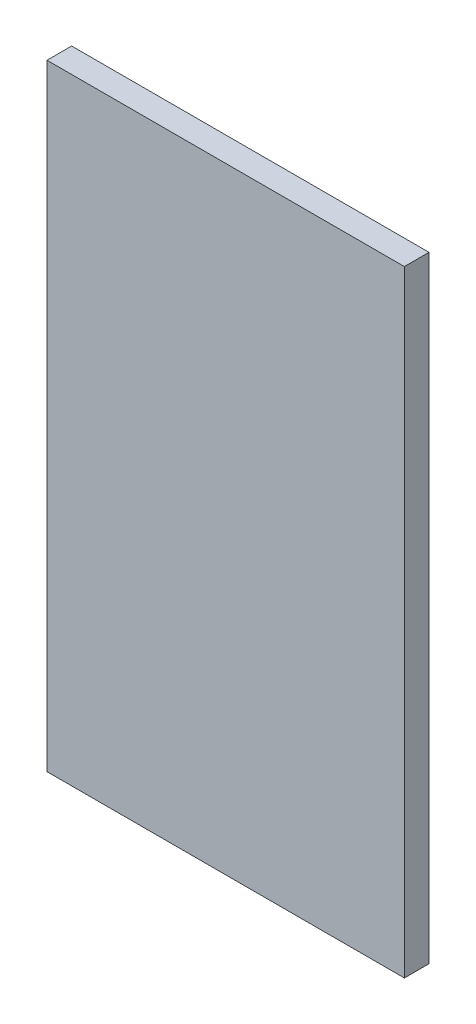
ISO-10303-21;
HEADER;
FILE_DESCRIPTION(('STEP AP214'),'2;1');
FILE_NAME('part.step','',(''),(''),'','','');
FILE_SCHEMA(('AUTOMOTIVE_DESIGN { 1 0 10303 214 1 1 1 1 }'));
ENDSEC;
DATA;
#1=APPLICATION_CONTEXT('core data for automotive mechanical design processes');
#2=APPLICATION_PROTOCOL_DEFINITION('international standard','automotive_design',2000,#1);
#3=PRODUCT_CONTEXT('',#1,'mechanical');
#4=PRODUCT('Part','Part','',(#3));
#5=PRODUCT_RELATED_PRODUCT_CATEGORY('part','',(#4));
#6=PRODUCT_DEFINITION_FORMATION('','',#4);
#7=PRODUCT_DEFINITION_CONTEXT('part definition',#1,'design');
#8=PRODUCT_DEFINITION('design','',#6,#7);
#9=PRODUCT_DEFINITION_SHAPE('','',#8);
#10=(LENGTH_UNIT() NAMED_UNIT(*) SI_UNIT(.MILLI.,.METRE.));
#11=(NAMED_UNIT(*) PLANE_ANGLE_UNIT() SI_UNIT($,.RADIAN.));
#12=(NAMED_UNIT(*) SI_UNIT($,.STERADIAN.) SOLID_ANGLE_UNIT());
#13=UNCERTAINTY_MEASURE_WITH_UNIT(LENGTH_MEASURE(1.E-05),#10,'distance_accuracy_value','');
#14=(GEOMETRIC_REPRESENTATION_CONTEXT(3) GLOBAL_UNCERTAINTY_ASSIGNED_CONTEXT((#13)) GLOBAL_UNIT_ASSIGNED_CONTEXT((#10,
#11,#12)) REPRESENTATION_CONTEXT('',''));
#15=CARTESIAN_POINT('',(0.,0.,0.));
#16=DIRECTION('',(0.,0.,1.));
#17=DIRECTION('',(1.,0.,0.));
#18=AXIS2_PLACEMENT_3D('',#15,#16,#17);
#19=CARTESIAN_POINT('',(0.,0.,12.));
#20=DIRECTION('',(0.,0.,1.));
#21=DIRECTION('',(1.,0.,0.));
#22=AXIS2_PLACEMENT_3D('',#19,#20,#21);
#23=PLANE('',#22);
#24=DIRECTION('',(1.,0.,0.));
#25=VECTOR('',#24,1.);
#26=CARTESIAN_POINT('',(-87.,-150.,12.));
#27=LINE('',#26,#25);
#28=CARTESIAN_POINT('',(-87.,-150.,12.));
#29=VERTEX_POINT('',#28);
#30=CARTESIAN_POINT('',(87.,-150.,12.));
#31=VERTEX_POINT('',#30);
#32=EDGE_CURVE('E80',#29,#31,#27,.T.);
#33=ORIENTED_EDGE('',*,*,#32,.T.);
#34=DIRECTION('',(0.,1.,0.));
#35=VECTOR('',#34,1.);
#36=CARTESIAN_POINT('',(87.,-150.,12.));
#37=LINE('',#36,#35);
#38=CARTESIAN_POINT('',(87.,150.,12.));
#39=VERTEX_POINT('',#38);
#40=EDGE_CURVE('E96',#31,#39,#37,.T.);
#41=ORIENTED_EDGE('',*,*,#40,.T.);
#42=DIRECTION('',(-1.,0.,0.));
#43=VECTOR('',#42,1.);
#44=CARTESIAN_POINT('',(87.,150.,12.));
#45=LINE('',#44,#43);
#46=CARTESIAN_POINT('',(-87.,150.,12.));
#47=VERTEX_POINT('',#46);
#48=EDGE_CURVE('E73',#39,#47,#45,.T.);
#49=ORIENTED_EDGE('',*,*,#48,.T.);
#50=DIRECTION('',(0.,-1.,0.));
#51=VECTOR('',#50,1.);
#52=CARTESIAN_POINT('',(-87.,150.,12.));
#53=LINE('',#52,#51);
#54=EDGE_CURVE('E10',#47,#29,#53,.T.);
#55=ORIENTED_EDGE('',*,*,#54,.T.);
#56=EDGE_LOOP('',(#33,#41,#49,#55));
#57=FACE_BOUND('',#56,.T.);
#58=ADVANCED_FACE('F16',(#57),#23,.T.);
#59=CARTESIAN_POINT('',(0.,0.,0.));
#60=DIRECTION('',(0.,0.,1.));
#61=DIRECTION('',(1.,0.,0.));
#62=AXIS2_PLACEMENT_3D('',#59,#60,#61);
#63=PLANE('',#62);
#64=DIRECTION('',(0.,-1.,0.));
#65=VECTOR('',#64,1.);
#66=CARTESIAN_POINT('',(-87.,150.,0.));
#67=LINE('',#66,#65);
#68=CARTESIAN_POINT('',(-87.,150.,0.));
#69=VERTEX_POINT('',#68);
#70=CARTESIAN_POINT('',(-87.,-150.,0.));
#71=VERTEX_POINT('',#70);
#72=EDGE_CURVE('E24',#69,#71,#67,.T.);
#73=ORIENTED_EDGE('',*,*,#72,.F.);
#74=DIRECTION('',(-1.,0.,0.));
#75=VECTOR('',#74,1.);
#76=CARTESIAN_POINT('',(87.,150.,0.));
#77=LINE('',#76,#75);
#78=CARTESIAN_POINT('',(87.,150.,0.));
#79=VERTEX_POINT('',#78);
#80=EDGE_CURVE('E95',#79,#69,#77,.T.);
#81=ORIENTED_EDGE('',*,*,#80,.F.);
#82=DIRECTION('',(0.,1.,0.));
#83=VECTOR('',#82,1.);
#84=CARTESIAN_POINT('',(87.,-150.,0.));
#85=LINE('',#84,#83);
#86=CARTESIAN_POINT('',(87.,-150.,0.));
#87=VERTEX_POINT('',#86);
#88=EDGE_CURVE('E82',#87,#79,#85,.T.);
#89=ORIENTED_EDGE('',*,*,#88,.F.);
#90=DIRECTION('',(1.,0.,0.));
#91=VECTOR('',#90,1.);
#92=CARTESIAN_POINT('',(-87.,-150.,0.));
#93=LINE('',#92,#91);
#94=EDGE_CURVE('E78',#71,#87,#93,.T.);
#95=ORIENTED_EDGE('',*,*,#94,.F.);
#96=EDGE_LOOP('',(#73,#81,#89,#95));
#97=FACE_BOUND('',#96,.T.);
#98=ADVANCED_FACE('F84',(#97),#63,.F.);
#99=CARTESIAN_POINT('',(-87.,150.,0.));
#100=DIRECTION('',(1.,0.,0.));
#101=DIRECTION('',(0.,1.,0.));
#102=AXIS2_PLACEMENT_3D('',#99,#100,#101);
#103=PLANE('',#102);
#104=ORIENTED_EDGE('',*,*,#72,.T.);
#105=DIRECTION('',(0.,0.,1.));
#106=VECTOR('',#105,1.);
#107=CARTESIAN_POINT('',(-87.,-150.,0.));
#108=LINE('',#107,#106);
#109=EDGE_CURVE('E67',#71,#29,#108,.T.);
#110=ORIENTED_EDGE('',*,*,#109,.T.);
#111=ORIENTED_EDGE('',*,*,#54,.F.);
#112=DIRECTION('',(0.,0.,1.));
#113=VECTOR('',#112,1.);
#114=CARTESIAN_POINT('',(-87.,150.,0.));
#115=LINE('',#114,#113);
#116=EDGE_CURVE('E70',#69,#47,#115,.T.);
#117=ORIENTED_EDGE('',*,*,#116,.F.);
#118=EDGE_LOOP('',(#104,#110,#111,#117));
#119=FACE_BOUND('',#118,.T.);
#120=ADVANCED_FACE('F66',(#119),#103,.F.);
#121=CARTESIAN_POINT('',(87.,150.,0.));
#122=DIRECTION('',(0.,-1.,0.));
#123=DIRECTION('',(0.,0.,-1.));
#124=AXIS2_PLACEMENT_3D('',#121,#122,#123);
#125=PLANE('',#124);
#126=ORIENTED_EDGE('',*,*,#80,.T.);
#127=ORIENTED_EDGE('',*,*,#116,.T.);
#128=ORIENTED_EDGE('',*,*,#48,.F.);
#129=DIRECTION('',(0.,0.,1.));
#130=VECTOR('',#129,1.);
#131=CARTESIAN_POINT('',(87.,150.,0.));
#132=LINE('',#131,#130);
#133=EDGE_CURVE('E106',#79,#39,#132,.T.);
#134=ORIENTED_EDGE('',*,*,#133,.F.);
#135=EDGE_LOOP('',(#126,#127,#128,#134));
#136=FACE_BOUND('',#135,.T.);
#137=ADVANCED_FACE('F118',(#136),#125,.F.);
#138=CARTESIAN_POINT('',(87.,-150.,0.));
#139=DIRECTION('',(-1.,0.,0.));
#140=DIRECTION('',(0.,0.,1.));
#141=AXIS2_PLACEMENT_3D('',#138,#139,#140);
#142=PLANE('',#141);
#143=ORIENTED_EDGE('',*,*,#88,.T.);
#144=ORIENTED_EDGE('',*,*,#133,.T.);
#145=ORIENTED_EDGE('',*,*,#40,.F.);
#146=DIRECTION('',(0.,0.,1.));
#147=VECTOR('',#146,1.);
#148=CARTESIAN_POINT('',(87.,-150.,0.));
#149=LINE('',#148,#147);
#150=EDGE_CURVE('E88',#87,#31,#149,.T.);
#151=ORIENTED_EDGE('',*,*,#150,.F.);
#152=EDGE_LOOP('',(#143,#144,#145,#151));
#153=FACE_BOUND('',#152,.T.);
#154=ADVANCED_FACE('F116',(#153),#142,.F.);
#155=CARTESIAN_POINT('',(-87.,-150.,0.));
#156=DIRECTION('',(0.,1.,0.));
#157=DIRECTION('',(1.,0.,0.));
#158=AXIS2_PLACEMENT_3D('',#155,#156,#157);
#159=PLANE('',#158);
#160=ORIENTED_EDGE('',*,*,#94,.T.);
#161=ORIENTED_EDGE('',*,*,#150,.T.);
#162=ORIENTED_EDGE('',*,*,#32,.F.);
#163=ORIENTED_EDGE('',*,*,#109,.F.);
#164=EDGE_LOOP('',(#160,#161,#162,#163));
#165=FACE_BOUND('',#164,.T.);
#166=ADVANCED_FACE('F76',(#165),#159,.F.);
#167=CLOSED_SHELL('',(#58,#98,#120,#137,#154,#166));
#168=MANIFOLD_SOLID_BREP('B1',#167);
#169=ADVANCED_BREP_SHAPE_REPRESENTATION('',(#18,#168),#14);
#170=SHAPE_DEFINITION_REPRESENTATION(#9,#169);
ENDSEC;
END-ISO-10303-21;
